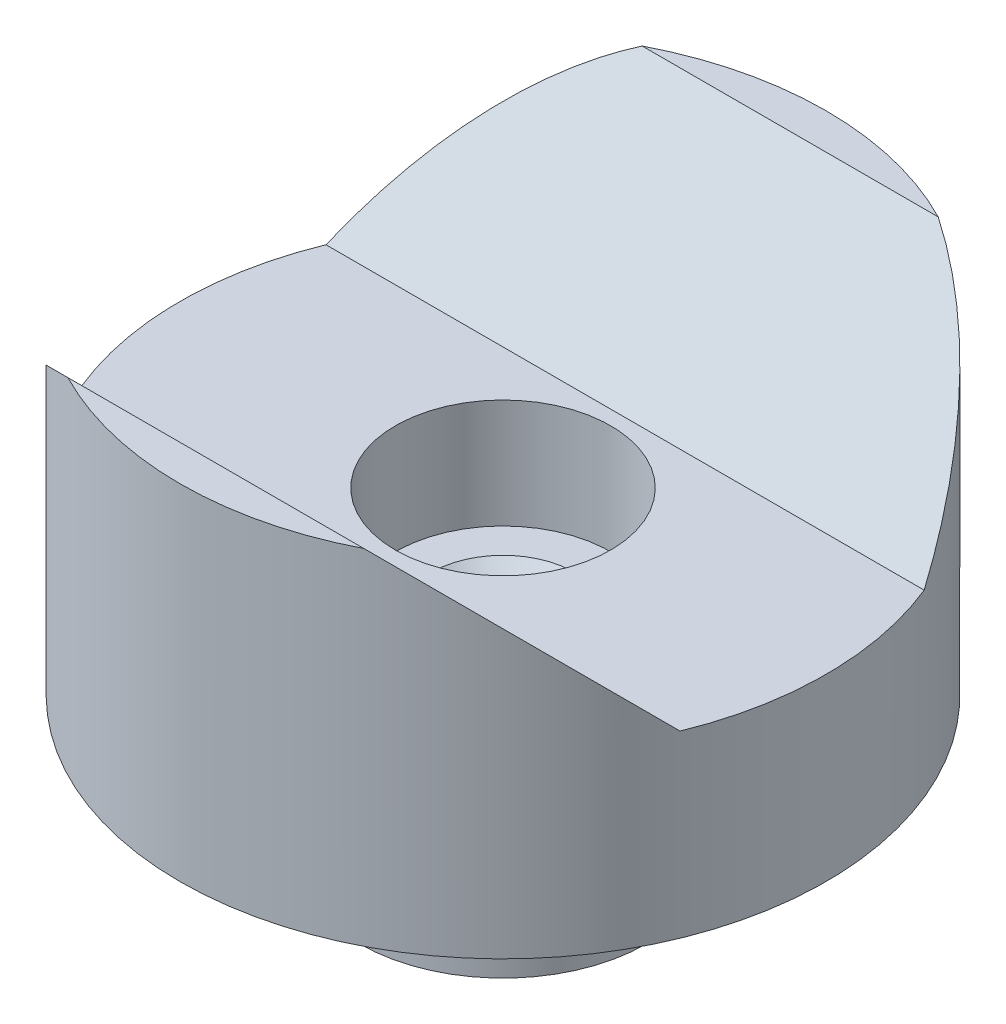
from build123d import *

# Parameters (mm, degrees)
SKETCH1_R               = 14.2875
EXTRUDE1_DEPTH          = 15.24
CUT_EXTRUDE1_DEPTH      = 26.308554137
CUT_EXTRUDE1_DEPTH_BACK = 26.308554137
SKETCH6_R               = 6.35
EXTRUDE2_DEPTH          = 6.35
CHAMFER1_SIZE           = 0.6223


with BuildPart() as part:
    # Sketch1 → Extrude1 (new body)
    with BuildSketch(Plane(origin=(0, 0, 0), x_dir=(1, 0, 0), z_dir=(0, 1, 0))):
        with Locations(Location((0, 0, 0), (0, 0, 90))):
            Circle(SKETCH1_R)
    extrude(amount=EXTRUDE1_DEPTH)

    # Sketch3 → Cut-Extrude1 (cut, two sides: drawn at the far end of the back side and taken through both)
    with BuildSketch(Plane(origin=(0, 0, 0), x_dir=(0, 0, -1), z_dir=(1, 0, 0)).offset(-CUT_EXTRUDE1_DEPTH_BACK)):
        Polygon((-12.7, 15.24), (12.7, 15.24), (5.3975, 7.9375), (-5.3975, 7.9375), align=None)
    extrude(amount=CUT_EXTRUDE1_DEPTH + CUT_EXTRUDE1_DEPTH_BACK, mode=Mode.SUBTRACT)

    # Sketch6 → Extrude2 (add)
    with BuildSketch(Plane.XZ):
        with Locations(Location((0, 0, 0), (0, 0, 90))):
            Circle(SKETCH6_R)
    extrude(amount=EXTRUDE2_DEPTH)

    # Sketch7 → Cut-Revolve1 (revolve, cut)
    with BuildSketch(Plane.XY, mode=Mode.PRIVATE) as cut_revolve1_sk:
        Polygon((0, -6.35), (2.5527, -6.35), (2.5527, 3.1115), (4.7625, 3.1115), (4.7625, 7.9375), (0, 7.9375), align=None)
    revolve(cut_revolve1_sk.sketch.rotate(Axis((0, 13.979393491, 0), (0, -1, 0)), 90), axis=Axis((0, 13.979393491, 0), (0, -1, 0)), mode=Mode.SUBTRACT)

    # Chamfer1
    chamfer1_edges = [part.edges().sort_by_distance(p)[0] for p in [
        (0, -6.35, -2.5527),
        (0, 3.1115, -2.5527),
    ]]
    chamfer(chamfer1_edges, length=CHAMFER1_SIZE)


solid = part.part
